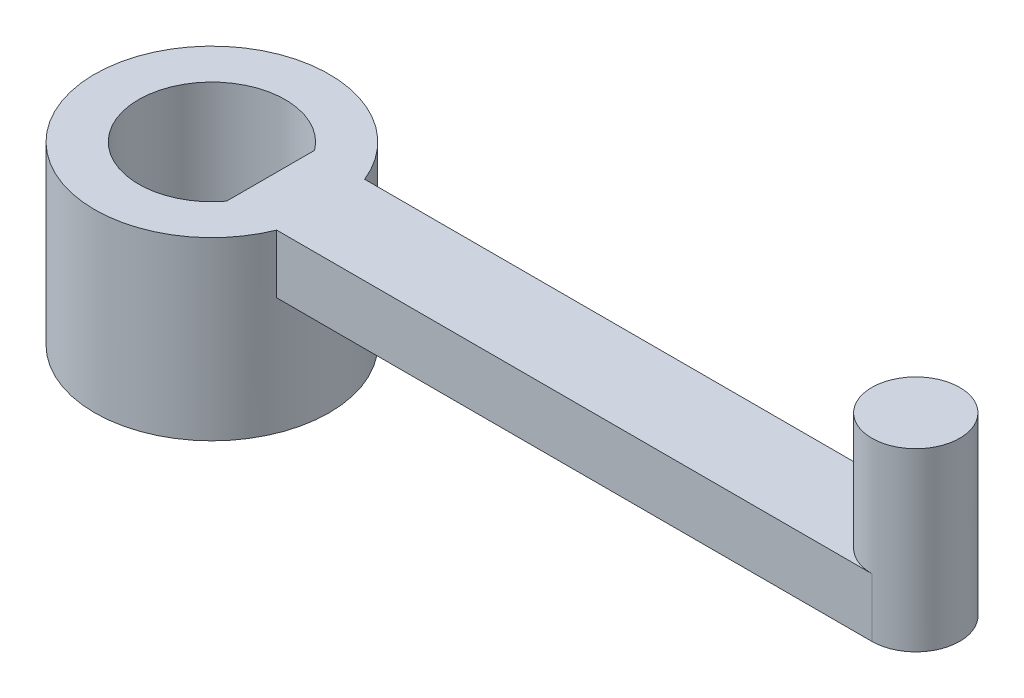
from build123d import *

# Parameters (mm, degrees)
BOSS_EXTRUDE1_DEPTH = 6.35
SKETCH1_3_R         = 12.7
BOSS_EXTRUDE2_DEPTH = 19.05
BOSS_EXTRUDE3_START = 12.7
BOSS_EXTRUDE3_DEPTH = 12.7


with BuildPart() as part:
    # Sketch1 → Boss-Extrude1 (new body)
    with BuildSketch(Plane(origin=(0, 0, 0), x_dir=(1, 0, 0), z_dir=(0, 1, 0))):
        with BuildLine():
            Line((76.2, 4.7625), (11.773215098, 4.7625))
            ThreePointArc((11.773215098, 4.7625), (12.466150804, 2.425919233), (12.7, 0))
            ThreePointArc((12.7, 0), (12.466150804, -2.425919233), (11.773215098, -4.7625))
            Line((11.773215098, -4.7625), (76.2, -4.7625))
            ThreePointArc((76.2, -4.7625), (71.4375, 0), (76.2, 4.7625))
        make_face()
        with BuildLine():
            ThreePointArc((80.9625, 0), (79.567596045, 3.367596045), (76.2, 4.7625))
            Line((76.2, 4.7625), (76.2, -4.7625))
            ThreePointArc((76.2, -4.7625), (79.567596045, -3.367596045), (80.9625, 0))
        make_face()
        with BuildLine():
            Line((76.2, -4.7625), (76.2, 4.7625))
            ThreePointArc((76.2, 4.7625), (71.4375, 0), (76.2, -4.7625))
        make_face()
        with BuildLine():
            ThreePointArc((80.9625, 0), (79.567596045, 3.367596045), (76.2, 4.7625))
            Line((76.2, 4.7625), (76.2, -4.7625))
            ThreePointArc((76.2, -4.7625), (79.567596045, -3.367596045), (80.9625, 0))
        make_face()
        with BuildLine():
            Line((76.2, -4.7625), (76.2, 4.7625))
            ThreePointArc((76.2, 4.7625), (71.4375, 0), (76.2, -4.7625))
        make_face()
    extrude(amount=-BOSS_EXTRUDE1_DEPTH)

    # Sketch1_3 → Boss-Extrude2 (add)
    with BuildSketch(Plane(origin=(0, 0, 0), x_dir=(1, 0, 0), z_dir=(0, 1, 0))):
        with Locations(Location((0, 0, 0), (0, 0, 270))):
            Circle(SKETCH1_3_R)
        with BuildLine():
            ThreePointArc((6.35, -4.7625), (-7.9375, 0), (6.35, 4.7625))
            Line((6.35, 4.7625), (6.35, -4.7625))
        make_face(mode=Mode.SUBTRACT)
    extrude(amount=-BOSS_EXTRUDE2_DEPTH)

    # Sketch1_4 → Boss-Extrude3 (add)
    with BuildSketch(Plane(origin=(0, 0, 0), x_dir=(1, 0, 0), z_dir=(0, 1, 0)).offset(BOSS_EXTRUDE3_START)):
        with BuildLine():
            ThreePointArc((80.9625, 0), (79.567596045, 3.367596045), (76.2, 4.7625))
            Line((76.2, 4.7625), (76.2, -4.7625))
            ThreePointArc((76.2, -4.7625), (79.567596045, -3.367596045), (80.9625, 0))
        make_face()
        with BuildLine():
            Line((76.2, -4.7625), (76.2, 4.7625))
            ThreePointArc((76.2, 4.7625), (71.4375, 0), (76.2, -4.7625))
        make_face()
        with BuildLine():
            ThreePointArc((80.9625, 0), (79.567596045, 3.367596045), (76.2, 4.7625))
            Line((76.2, 4.7625), (76.2, -4.7625))
            ThreePointArc((76.2, -4.7625), (79.567596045, -3.367596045), (80.9625, 0))
        make_face()
        with BuildLine():
            Line((76.2, -4.7625), (76.2, 4.7625))
            ThreePointArc((76.2, 4.7625), (71.4375, 0), (76.2, -4.7625))
        make_face()
    extrude(amount=-BOSS_EXTRUDE3_DEPTH)


solid = part.part
